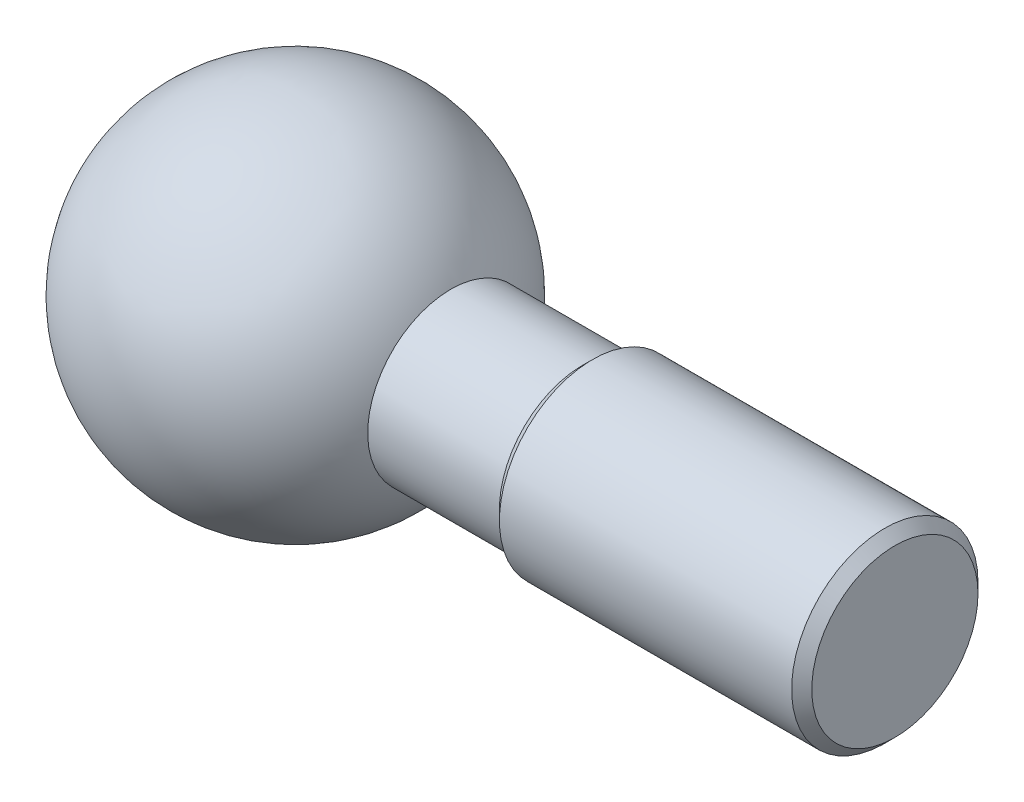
ISO-10303-21;
HEADER;
FILE_DESCRIPTION(('STEP AP214'),'2;1');
FILE_NAME('part.step','',(''),(''),'','','');
FILE_SCHEMA(('AUTOMOTIVE_DESIGN { 1 0 10303 214 1 1 1 1 }'));
ENDSEC;
DATA;
#1=APPLICATION_CONTEXT('core data for automotive mechanical design processes');
#2=APPLICATION_PROTOCOL_DEFINITION('international standard','automotive_design',2000,#1);
#3=PRODUCT_CONTEXT('',#1,'mechanical');
#4=PRODUCT('Part','Part','',(#3));
#5=PRODUCT_RELATED_PRODUCT_CATEGORY('part','',(#4));
#6=PRODUCT_DEFINITION_FORMATION('','',#4);
#7=PRODUCT_DEFINITION_CONTEXT('part definition',#1,'design');
#8=PRODUCT_DEFINITION('design','',#6,#7);
#9=PRODUCT_DEFINITION_SHAPE('','',#8);
#10=(LENGTH_UNIT() NAMED_UNIT(*) SI_UNIT(.MILLI.,.METRE.));
#11=(NAMED_UNIT(*) PLANE_ANGLE_UNIT() SI_UNIT($,.RADIAN.));
#12=(NAMED_UNIT(*) SI_UNIT($,.STERADIAN.) SOLID_ANGLE_UNIT());
#13=UNCERTAINTY_MEASURE_WITH_UNIT(LENGTH_MEASURE(1.E-05),#10,'distance_accuracy_value','');
#14=(GEOMETRIC_REPRESENTATION_CONTEXT(3) GLOBAL_UNCERTAINTY_ASSIGNED_CONTEXT((#13)) GLOBAL_UNIT_ASSIGNED_CONTEXT((#10,
#11,#12)) REPRESENTATION_CONTEXT('',''));
#15=CARTESIAN_POINT('',(0.,0.,0.));
#16=DIRECTION('',(0.,0.,1.));
#17=DIRECTION('',(1.,0.,0.));
#18=AXIS2_PLACEMENT_3D('',#15,#16,#17);
#19=CARTESIAN_POINT('',(-44.5866648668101,2.65,0.));
#20=DIRECTION('',(1.,0.,0.));
#21=DIRECTION('',(0.,1.,0.));
#22=AXIS2_PLACEMENT_3D('',#19,#20,#21);
#23=SPHERICAL_SURFACE('',#22,3.5);
#24=CARTESIAN_POINT('',(-41.5,2.65,0.));
#25=DIRECTION('',(1.,0.,0.));
#26=DIRECTION('',(0.,0.,-1.));
#27=AXIS2_PLACEMENT_3D('',#24,#25,#26);
#28=CIRCLE('',#27,1.65);
#29=CARTESIAN_POINT('',(-41.5,2.65,-1.65));
#30=VERTEX_POINT('',#29);
#31=EDGE_CURVE('E10',#30,#30,#28,.T.);
#32=ORIENTED_EDGE('',*,*,#31,.F.);
#33=EDGE_LOOP('',(#32));
#34=FACE_BOUND('',#33,.T.);
#35=ADVANCED_FACE('F348',(#34),#23,.T.);
#36=CARTESIAN_POINT('',(-29.5,2.65,0.));
#37=DIRECTION('',(1.,0.,0.));
#38=DIRECTION('',(0.,0.,-1.));
#39=AXIS2_PLACEMENT_3D('',#36,#37,#38);
#40=CYLINDRICAL_SURFACE('',#39,1.65);
#41=CARTESIAN_POINT('',(-38.8852762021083,2.65,0.));
#42=DIRECTION('',(1.,0.,0.));
#43=DIRECTION('',(0.,0.,-1.));
#44=AXIS2_PLACEMENT_3D('',#41,#42,#43);
#45=CIRCLE('',#44,1.65);
#46=CARTESIAN_POINT('',(-38.8852762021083,2.65,-1.65));
#47=VERTEX_POINT('',#46);
#48=EDGE_CURVE('E354',#47,#47,#45,.T.);
#49=ORIENTED_EDGE('',*,*,#48,.F.);
#50=EDGE_LOOP('',(#49));
#51=FACE_BOUND('',#50,.T.);
#52=ORIENTED_EDGE('',*,*,#31,.T.);
#53=EDGE_LOOP('',(#52));
#54=FACE_BOUND('',#53,.T.);
#55=ADVANCED_FACE('F387',(#51,#54),#40,.T.);
#56=CARTESIAN_POINT('',(-38.8852762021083,2.65,0.));
#57=DIRECTION('',(1.,0.,0.));
#58=DIRECTION('',(0.,0.,-1.));
#59=AXIS2_PLACEMENT_3D('',#56,#57,#58);
#60=CONICAL_SURFACE('',#59,1.65,0.78539816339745);
#61=CARTESIAN_POINT('',(-38.6852762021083,2.65,0.));
#62=DIRECTION('',(1.,0.,0.));
#63=DIRECTION('',(0.,0.,-1.));
#64=AXIS2_PLACEMENT_3D('',#61,#62,#63);
#65=CIRCLE('',#64,1.85);
#66=CARTESIAN_POINT('',(-38.6852762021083,2.65,-1.85));
#67=VERTEX_POINT('',#66);
#68=EDGE_CURVE('E358',#67,#67,#65,.T.);
#69=ORIENTED_EDGE('',*,*,#68,.F.);
#70=EDGE_LOOP('',(#69));
#71=FACE_BOUND('',#70,.T.);
#72=ORIENTED_EDGE('',*,*,#48,.T.);
#73=EDGE_LOOP('',(#72));
#74=FACE_BOUND('',#73,.T.);
#75=ADVANCED_FACE('F382',(#71,#74),#60,.T.);
#76=CARTESIAN_POINT('',(-29.5,2.65,0.));
#77=DIRECTION('',(1.,0.,0.));
#78=DIRECTION('',(0.,0.,-1.));
#79=AXIS2_PLACEMENT_3D('',#76,#77,#78);
#80=CYLINDRICAL_SURFACE('',#79,1.85);
#81=CARTESIAN_POINT('',(-32.8852762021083,2.65,0.));
#82=DIRECTION('',(1.,0.,0.));
#83=DIRECTION('',(0.,0.,-1.));
#84=AXIS2_PLACEMENT_3D('',#81,#82,#83);
#85=CIRCLE('',#84,1.85);
#86=CARTESIAN_POINT('',(-32.8852762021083,2.65,-1.85));
#87=VERTEX_POINT('',#86);
#88=EDGE_CURVE('E362',#87,#87,#85,.T.);
#89=ORIENTED_EDGE('',*,*,#88,.F.);
#90=EDGE_LOOP('',(#89));
#91=FACE_BOUND('',#90,.T.);
#92=ORIENTED_EDGE('',*,*,#68,.T.);
#93=EDGE_LOOP('',(#92));
#94=FACE_BOUND('',#93,.T.);
#95=ADVANCED_FACE('F376',(#91,#94),#80,.T.);
#96=CARTESIAN_POINT('',(-32.8852762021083,2.65,0.));
#97=DIRECTION('',(-1.,0.,0.));
#98=DIRECTION('',(0.,0.,1.));
#99=AXIS2_PLACEMENT_3D('',#96,#97,#98);
#100=CONICAL_SURFACE('',#99,1.85,0.785398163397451);
#101=CARTESIAN_POINT('',(-32.6852762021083,2.65,0.));
#102=DIRECTION('',(1.,0.,0.));
#103=DIRECTION('',(0.,0.,-1.));
#104=AXIS2_PLACEMENT_3D('',#101,#102,#103);
#105=CIRCLE('',#104,1.65);
#106=CARTESIAN_POINT('',(-32.6852762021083,2.65,-1.65));
#107=VERTEX_POINT('',#106);
#108=EDGE_CURVE('E367',#107,#107,#105,.T.);
#109=ORIENTED_EDGE('',*,*,#108,.F.);
#110=EDGE_LOOP('',(#109));
#111=FACE_BOUND('',#110,.T.);
#112=ORIENTED_EDGE('',*,*,#88,.T.);
#113=EDGE_LOOP('',(#112));
#114=FACE_BOUND('',#113,.T.);
#115=ADVANCED_FACE('F373',(#111,#114),#100,.T.);
#116=CARTESIAN_POINT('',(-32.6852762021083,2.65,0.));
#117=DIRECTION('',(-1.,0.,0.));
#118=DIRECTION('',(0.,0.,1.));
#119=AXIS2_PLACEMENT_3D('',#116,#117,#118);
#120=PLANE('',#119);
#121=ORIENTED_EDGE('',*,*,#108,.T.);
#122=EDGE_LOOP('',(#121));
#123=FACE_BOUND('',#122,.T.);
#124=ADVANCED_FACE('F371',(#123),#120,.F.);
#125=CLOSED_SHELL('',(#35,#55,#75,#95,#115,#124));
#126=MANIFOLD_SOLID_BREP('B2',#125);
#127=ADVANCED_BREP_SHAPE_REPRESENTATION('',(#18,#126),#14);
#128=SHAPE_DEFINITION_REPRESENTATION(#9,#127);
ENDSEC;
END-ISO-10303-21;
